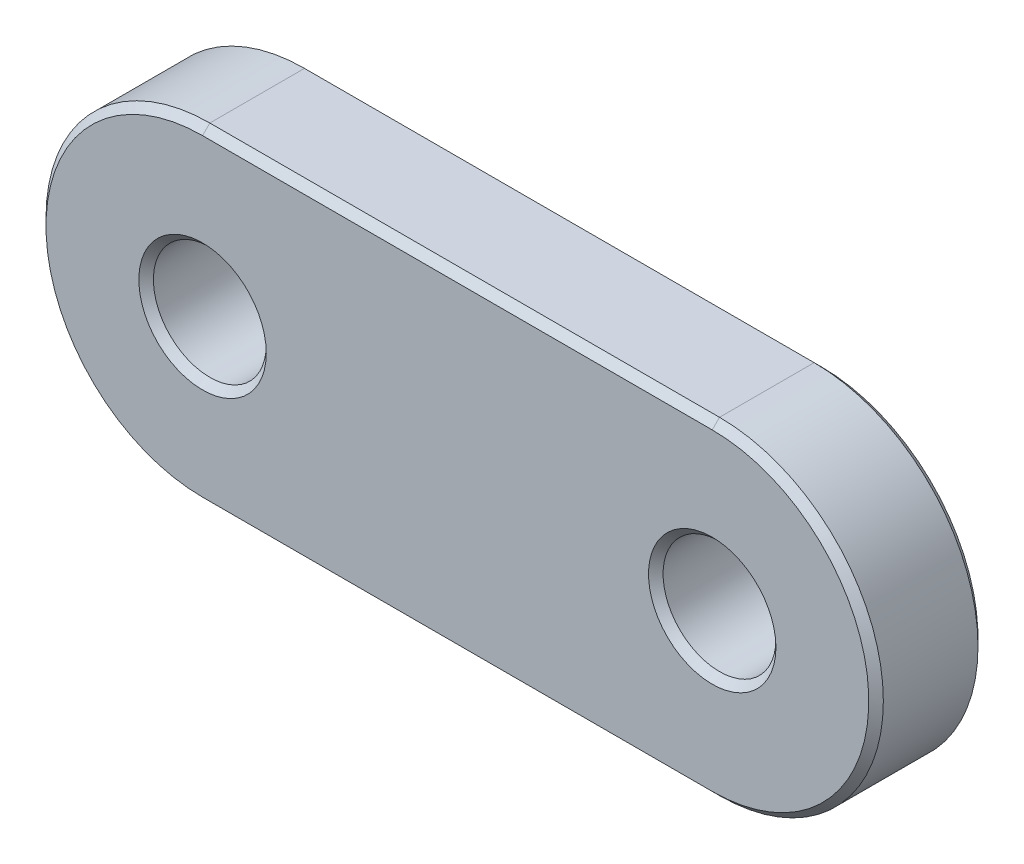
from build123d import *

# Parameters (mm, degrees)
SKETCH_1_R      = 1.55
EXTRUDE_1_DEPTH = 1.5
CHAMFER_1_SIZE  = 0.2
CHAMFER_2_SIZE  = 0.2


with BuildPart() as part:
    # Sketch 1 → Extrude 1 (new, symmetric)
    with BuildSketch(Plane.XY):
        with BuildLine():
            Line((7, -4.5), (-7, -4.5))
            ThreePointArc((-7, -4.5), (-11.5, 0), (-7, 4.5))
            Line((-7, 4.5), (7, 4.5))
            ThreePointArc((7, 4.5), (11.5, 0), (7, -4.5))
        make_face()
        with Locations((-7, 0)):
            Circle(SKETCH_1_R, mode=Mode.SUBTRACT)
        with Locations((7, 0)):
            Circle(SKETCH_1_R, mode=Mode.SUBTRACT)
    extrude(amount=EXTRUDE_1_DEPTH, both=True)

    # Chamfer 1
    chamfer_1_edges = [part.edges().sort_by_distance(p)[0] for p in [
        (11.5, 0, 1.5),
        (0, 4.5, 1.5),
        (-11.5, 0, 1.5),
        (0, 4.5, -1.5),
        (11.5, 0, -1.5),
        (0, -4.5, -1.5),
        (-11.5, 0, -1.5),
        (0, -4.5, 1.5),
    ]]
    chamfer(chamfer_1_edges, length=CHAMFER_1_SIZE)

    # Chamfer 2
    chamfer_2_edges = [part.edges().sort_by_distance(p)[0] for p in [
        (-8.55, 0, -1.5),
        (-8.55, 0, 1.5),
        (5.45, 0, -1.5),
        (5.45, 0, 1.5),
    ]]
    chamfer(chamfer_2_edges, length=CHAMFER_2_SIZE)


solid = part.part
